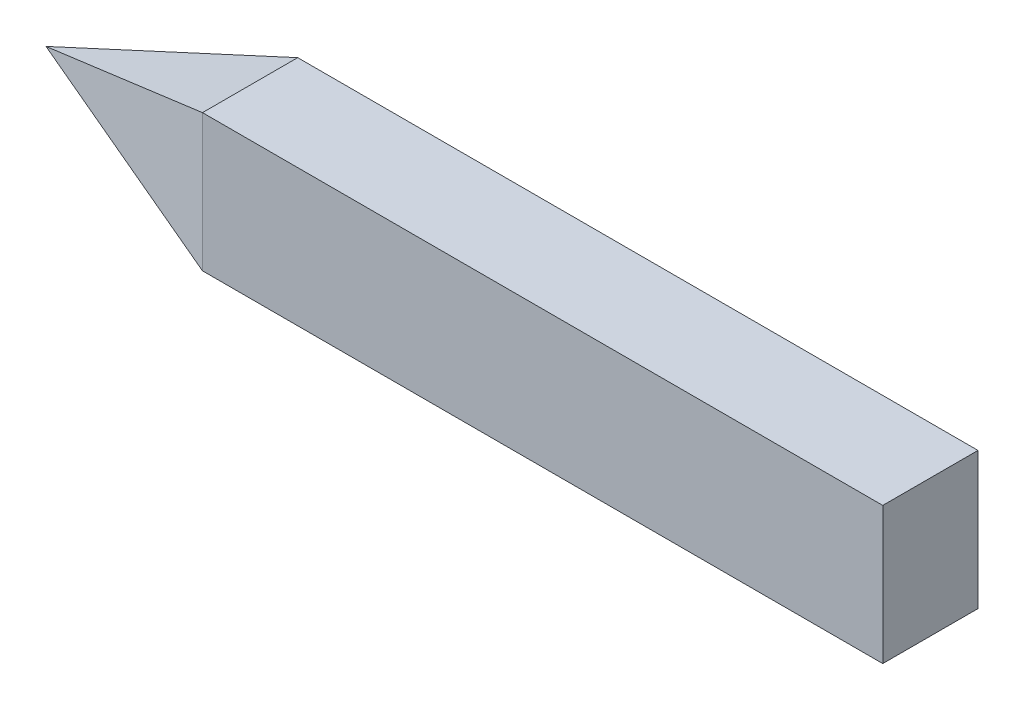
from build123d import *

# Parameters (mm, degrees)
EXTRUDE1_DEPTH = 17.5


with BuildPart() as part:
    # Sketch1 → Extrude1 (new, symmetric)
    with BuildSketch(Plane.XY):
        Polygon((75, 25.173242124), (0, 0), (75, -25.173242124), (325, -25.173242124), (325, 25.173242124), align=None)
    extrude(amount=EXTRUDE1_DEPTH, both=True)

    # Split1
    split(bisect_by=Plane(origin=(0, 0, 0), x_dir=(-0.9738412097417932, 0, 0.2272296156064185), z_dir=(-0.2272296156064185, 0, -0.9738412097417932)), keep=Keep.BOTTOM)

    # Split2
    split(bisect_by=Plane(origin=(0, 0, 0), x_dir=(-0.9738412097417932, 0, -0.2272296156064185), z_dir=(0.2272296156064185, 0, -0.9738412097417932)), keep=Keep.TOP)


solid = part.part
